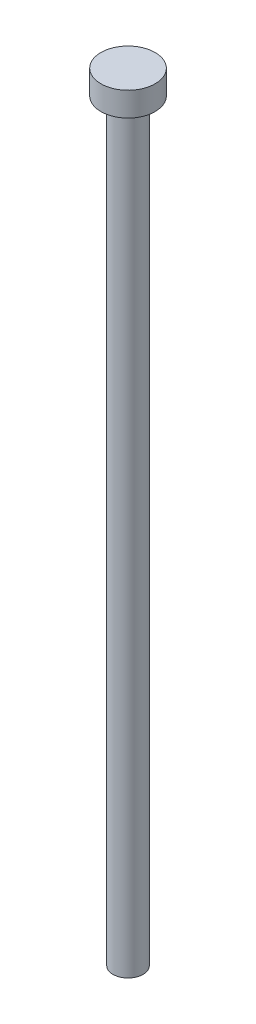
from build123d import *


with BuildPart() as part:
    # Sketch1 → Revolve1 (revolve)
    with BuildSketch(Plane.XY):
        Polygon((0, 0), (0, 65.532), (2.286, 65.532), (2.286, 63.5), (1.27, 63.5), (1.27, 0), align=None)
    revolve(axis=Axis((0, 0, 0), (0, 1, 0)))


solid = part.part
